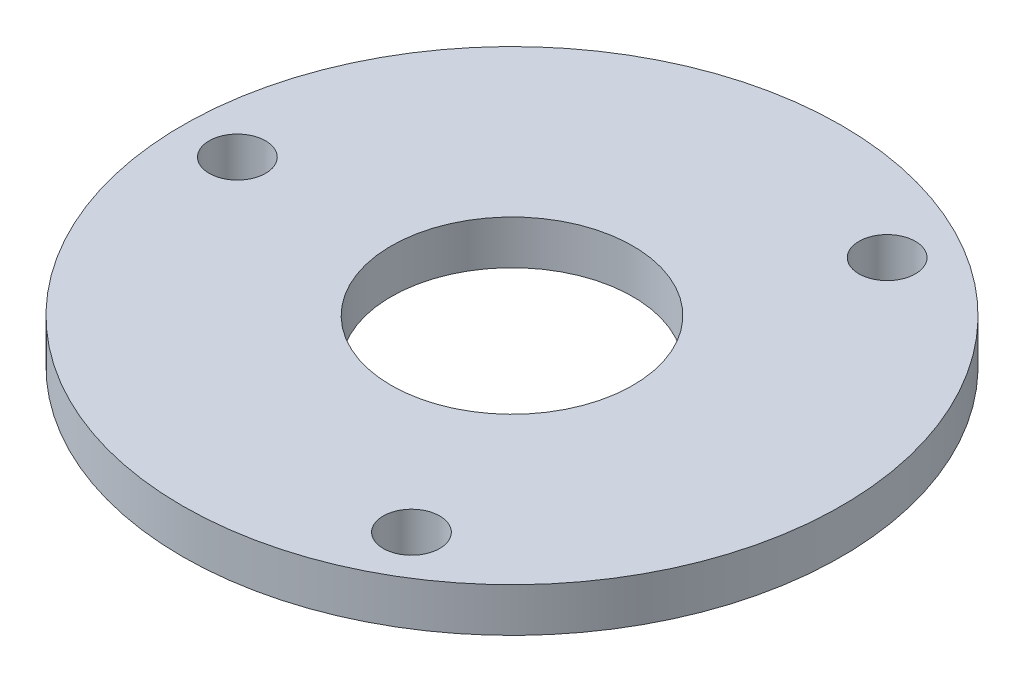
ISO-10303-21;
HEADER;
FILE_DESCRIPTION(('STEP AP214'),'2;1');
FILE_NAME('part.step','',(''),(''),'','','');
FILE_SCHEMA(('AUTOMOTIVE_DESIGN { 1 0 10303 214 1 1 1 1 }'));
ENDSEC;
DATA;
#1=APPLICATION_CONTEXT('core data for automotive mechanical design processes');
#2=APPLICATION_PROTOCOL_DEFINITION('international standard','automotive_design',2000,#1);
#3=PRODUCT_CONTEXT('',#1,'mechanical');
#4=PRODUCT('Part','Part','',(#3));
#5=PRODUCT_RELATED_PRODUCT_CATEGORY('part','',(#4));
#6=PRODUCT_DEFINITION_FORMATION('','',#4);
#7=PRODUCT_DEFINITION_CONTEXT('part definition',#1,'design');
#8=PRODUCT_DEFINITION('design','',#6,#7);
#9=PRODUCT_DEFINITION_SHAPE('','',#8);
#10=(LENGTH_UNIT() NAMED_UNIT(*) SI_UNIT(.MILLI.,.METRE.));
#11=(NAMED_UNIT(*) PLANE_ANGLE_UNIT() SI_UNIT($,.RADIAN.));
#12=(NAMED_UNIT(*) SI_UNIT($,.STERADIAN.) SOLID_ANGLE_UNIT());
#13=UNCERTAINTY_MEASURE_WITH_UNIT(LENGTH_MEASURE(1.E-05),#10,'distance_accuracy_value','');
#14=(GEOMETRIC_REPRESENTATION_CONTEXT(3) GLOBAL_UNCERTAINTY_ASSIGNED_CONTEXT((#13)) GLOBAL_UNIT_ASSIGNED_CONTEXT((#10,
#11,#12)) REPRESENTATION_CONTEXT('',''));
#15=CARTESIAN_POINT('',(0.,0.,0.));
#16=DIRECTION('',(0.,0.,1.));
#17=DIRECTION('',(1.,0.,0.));
#18=AXIS2_PLACEMENT_3D('',#15,#16,#17);
#19=CARTESIAN_POINT('',(0.,2.54,0.));
#20=DIRECTION('',(0.,1.,0.));
#21=DIRECTION('',(0.,0.,1.));
#22=AXIS2_PLACEMENT_3D('',#19,#20,#21);
#23=PLANE('',#22);
#24=CARTESIAN_POINT('',(7.93749999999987,2.54,-13.748153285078));
#25=DIRECTION('',(0.,1.,0.));
#26=DIRECTION('',(0.,0.,1.));
#27=AXIS2_PLACEMENT_3D('',#24,#25,#26);
#28=CIRCLE('',#27,1.63195);
#29=CARTESIAN_POINT('',(7.93749999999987,2.54,-12.116203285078));
#30=VERTEX_POINT('',#29);
#31=EDGE_CURVE('E88',#30,#30,#28,.T.);
#32=ORIENTED_EDGE('',*,*,#31,.F.);
#33=EDGE_LOOP('',(#32));
#34=FACE_BOUND('',#33,.T.);
#35=CARTESIAN_POINT('',(7.93750000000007,2.54,13.7481532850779));
#36=DIRECTION('',(0.,1.,0.));
#37=DIRECTION('',(0.,0.,1.));
#38=AXIS2_PLACEMENT_3D('',#35,#36,#37);
#39=CIRCLE('',#38,1.63195);
#40=CARTESIAN_POINT('',(7.93750000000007,2.54,15.3801032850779));
#41=VERTEX_POINT('',#40);
#42=EDGE_CURVE('E82',#41,#41,#39,.T.);
#43=ORIENTED_EDGE('',*,*,#42,.F.);
#44=EDGE_LOOP('',(#43));
#45=FACE_BOUND('',#44,.T.);
#46=CARTESIAN_POINT('',(-15.875,2.54,0.));
#47=DIRECTION('',(0.,1.,0.));
#48=DIRECTION('',(0.,0.,1.));
#49=AXIS2_PLACEMENT_3D('',#46,#47,#48);
#50=CIRCLE('',#49,1.63195);
#51=CARTESIAN_POINT('',(-15.875,2.54,1.63195));
#52=VERTEX_POINT('',#51);
#53=EDGE_CURVE('E76',#52,#52,#50,.T.);
#54=ORIENTED_EDGE('',*,*,#53,.F.);
#55=EDGE_LOOP('',(#54));
#56=FACE_BOUND('',#55,.T.);
#57=CARTESIAN_POINT('',(0.,2.54,0.));
#58=DIRECTION('',(0.,1.,0.));
#59=DIRECTION('',(0.,0.,1.));
#60=AXIS2_PLACEMENT_3D('',#57,#58,#59);
#61=CIRCLE('',#60,19.05);
#62=CARTESIAN_POINT('',(0.,2.54,19.05));
#63=VERTEX_POINT('',#62);
#64=EDGE_CURVE('E12',#63,#63,#61,.T.);
#65=ORIENTED_EDGE('',*,*,#64,.T.);
#66=EDGE_LOOP('',(#65));
#67=FACE_BOUND('',#66,.T.);
#68=CARTESIAN_POINT('',(0.,2.54,0.));
#69=DIRECTION('',(0.,1.,0.));
#70=DIRECTION('',(0.,0.,1.));
#71=AXIS2_PLACEMENT_3D('',#68,#69,#70);
#72=CIRCLE('',#71,6.985);
#73=CARTESIAN_POINT('',(0.,2.54,6.985));
#74=VERTEX_POINT('',#73);
#75=EDGE_CURVE('E66',#74,#74,#72,.T.);
#76=ORIENTED_EDGE('',*,*,#75,.F.);
#77=EDGE_LOOP('',(#76));
#78=FACE_BOUND('',#77,.T.);
#79=ADVANCED_FACE('F55',(#34,#45,#56,#67,#78),#23,.T.);
#80=CARTESIAN_POINT('',(0.,0.,0.));
#81=DIRECTION('',(0.,1.,0.));
#82=DIRECTION('',(0.,0.,1.));
#83=AXIS2_PLACEMENT_3D('',#80,#81,#82);
#84=PLANE('',#83);
#85=CARTESIAN_POINT('',(7.93749999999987,0.,-13.748153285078));
#86=DIRECTION('',(0.,1.,0.));
#87=DIRECTION('',(0.,0.,1.));
#88=AXIS2_PLACEMENT_3D('',#85,#86,#87);
#89=CIRCLE('',#88,1.63195);
#90=CARTESIAN_POINT('',(7.93749999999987,0.,-12.116203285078));
#91=VERTEX_POINT('',#90);
#92=EDGE_CURVE('E85',#91,#91,#89,.T.);
#93=ORIENTED_EDGE('',*,*,#92,.T.);
#94=EDGE_LOOP('',(#93));
#95=FACE_BOUND('',#94,.T.);
#96=CARTESIAN_POINT('',(7.93750000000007,0.,13.7481532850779));
#97=DIRECTION('',(0.,1.,0.));
#98=DIRECTION('',(0.,0.,1.));
#99=AXIS2_PLACEMENT_3D('',#96,#97,#98);
#100=CIRCLE('',#99,1.63195);
#101=CARTESIAN_POINT('',(7.93750000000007,0.,15.3801032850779));
#102=VERTEX_POINT('',#101);
#103=EDGE_CURVE('E79',#102,#102,#100,.T.);
#104=ORIENTED_EDGE('',*,*,#103,.T.);
#105=EDGE_LOOP('',(#104));
#106=FACE_BOUND('',#105,.T.);
#107=CARTESIAN_POINT('',(-15.875,0.,0.));
#108=DIRECTION('',(0.,1.,0.));
#109=DIRECTION('',(0.,0.,1.));
#110=AXIS2_PLACEMENT_3D('',#107,#108,#109);
#111=CIRCLE('',#110,1.63195);
#112=CARTESIAN_POINT('',(-15.875,0.,1.63195));
#113=VERTEX_POINT('',#112);
#114=EDGE_CURVE('E71',#113,#113,#111,.T.);
#115=ORIENTED_EDGE('',*,*,#114,.T.);
#116=EDGE_LOOP('',(#115));
#117=FACE_BOUND('',#116,.T.);
#118=CARTESIAN_POINT('',(0.,0.,0.));
#119=DIRECTION('',(0.,1.,0.));
#120=DIRECTION('',(0.,0.,1.));
#121=AXIS2_PLACEMENT_3D('',#118,#119,#120);
#122=CIRCLE('',#121,19.05);
#123=CARTESIAN_POINT('',(0.,0.,19.05));
#124=VERTEX_POINT('',#123);
#125=EDGE_CURVE('E59',#124,#124,#122,.T.);
#126=ORIENTED_EDGE('',*,*,#125,.F.);
#127=EDGE_LOOP('',(#126));
#128=FACE_BOUND('',#127,.T.);
#129=CARTESIAN_POINT('',(0.,0.,0.));
#130=DIRECTION('',(0.,1.,0.));
#131=DIRECTION('',(0.,0.,1.));
#132=AXIS2_PLACEMENT_3D('',#129,#130,#131);
#133=CIRCLE('',#132,6.985);
#134=CARTESIAN_POINT('',(0.,0.,6.985));
#135=VERTEX_POINT('',#134);
#136=EDGE_CURVE('E68',#135,#135,#133,.T.);
#137=ORIENTED_EDGE('',*,*,#136,.T.);
#138=EDGE_LOOP('',(#137));
#139=FACE_BOUND('',#138,.T.);
#140=ADVANCED_FACE('F96',(#95,#106,#117,#128,#139),#84,.F.);
#141=CARTESIAN_POINT('',(0.,2.54,0.));
#142=DIRECTION('',(0.,-1.,0.));
#143=DIRECTION('',(0.,0.,-1.));
#144=AXIS2_PLACEMENT_3D('',#141,#142,#143);
#145=CYLINDRICAL_SURFACE('',#144,19.05);
#146=ORIENTED_EDGE('',*,*,#64,.F.);
#147=EDGE_LOOP('',(#146));
#148=FACE_BOUND('',#147,.T.);
#149=ORIENTED_EDGE('',*,*,#125,.T.);
#150=EDGE_LOOP('',(#149));
#151=FACE_BOUND('',#150,.T.);
#152=ADVANCED_FACE('F57',(#148,#151),#145,.T.);
#153=CARTESIAN_POINT('',(0.,2.54,0.));
#154=DIRECTION('',(0.,-1.,0.));
#155=DIRECTION('',(0.,0.,-1.));
#156=AXIS2_PLACEMENT_3D('',#153,#154,#155);
#157=CYLINDRICAL_SURFACE('',#156,6.985);
#158=ORIENTED_EDGE('',*,*,#75,.T.);
#159=EDGE_LOOP('',(#158));
#160=FACE_BOUND('',#159,.T.);
#161=ORIENTED_EDGE('',*,*,#136,.F.);
#162=EDGE_LOOP('',(#161));
#163=FACE_BOUND('',#162,.T.);
#164=ADVANCED_FACE('F104',(#160,#163),#157,.F.);
#165=CARTESIAN_POINT('',(-15.875,2.54,0.));
#166=DIRECTION('',(0.,1.,0.));
#167=DIRECTION('',(0.,0.,1.));
#168=AXIS2_PLACEMENT_3D('',#165,#166,#167);
#169=CYLINDRICAL_SURFACE('',#168,1.63195);
#170=ORIENTED_EDGE('',*,*,#114,.F.);
#171=EDGE_LOOP('',(#170));
#172=FACE_BOUND('',#171,.T.);
#173=ORIENTED_EDGE('',*,*,#53,.T.);
#174=EDGE_LOOP('',(#173));
#175=FACE_BOUND('',#174,.T.);
#176=ADVANCED_FACE('F107',(#172,#175),#169,.F.);
#177=CARTESIAN_POINT('',(7.93750000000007,2.54,13.7481532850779));
#178=DIRECTION('',(0.,1.,0.));
#179=DIRECTION('',(0.,0.,1.));
#180=AXIS2_PLACEMENT_3D('',#177,#178,#179);
#181=CYLINDRICAL_SURFACE('',#180,1.63195);
#182=ORIENTED_EDGE('',*,*,#103,.F.);
#183=EDGE_LOOP('',(#182));
#184=FACE_BOUND('',#183,.T.);
#185=ORIENTED_EDGE('',*,*,#42,.T.);
#186=EDGE_LOOP('',(#185));
#187=FACE_BOUND('',#186,.T.);
#188=ADVANCED_FACE('F121',(#184,#187),#181,.F.);
#189=CARTESIAN_POINT('',(7.93749999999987,2.54,-13.748153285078));
#190=DIRECTION('',(0.,1.,0.));
#191=DIRECTION('',(0.,0.,1.));
#192=AXIS2_PLACEMENT_3D('',#189,#190,#191);
#193=CYLINDRICAL_SURFACE('',#192,1.63195);
#194=ORIENTED_EDGE('',*,*,#92,.F.);
#195=EDGE_LOOP('',(#194));
#196=FACE_BOUND('',#195,.T.);
#197=ORIENTED_EDGE('',*,*,#31,.T.);
#198=EDGE_LOOP('',(#197));
#199=FACE_BOUND('',#198,.T.);
#200=ADVANCED_FACE('F92',(#196,#199),#193,.F.);
#201=CLOSED_SHELL('',(#79,#140,#152,#164,#176,#188,#200));
#202=MANIFOLD_SOLID_BREP('B2',#201);
#203=ADVANCED_BREP_SHAPE_REPRESENTATION('',(#18,#202),#14);
#204=SHAPE_DEFINITION_REPRESENTATION(#9,#203);
ENDSEC;
END-ISO-10303-21;
